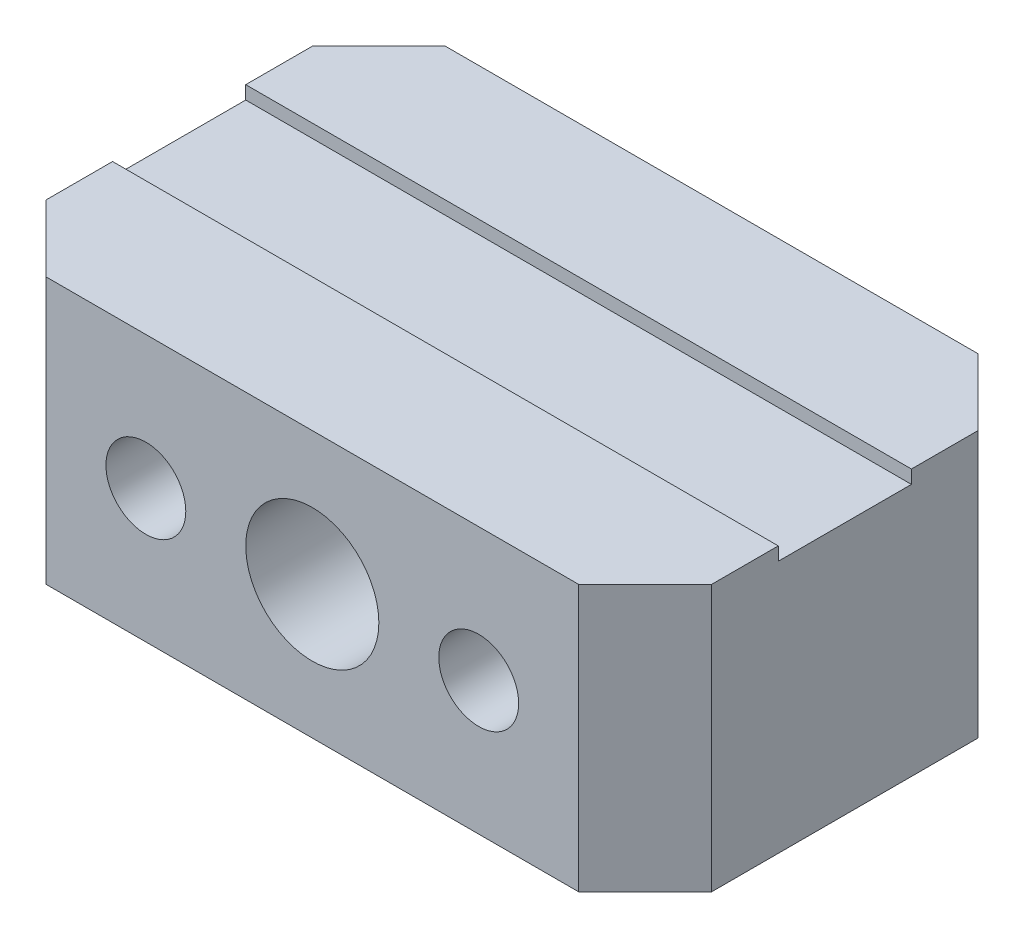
from build123d import *

# Parameters (mm, degrees)
SKETCH_1_W          = 100
SKETCH_1_H          = 40
EXTRUDE_1_DEPTH     = 60
SKETCH_2_R          = 10
CUT_EXTRUDE_1_DEPTH = 81.622577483
SKETCH_3_R          = 6
CUT_EXTRUDE_2_DEPTH = 81.622577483
SKETCH_4_W          = 100
SKETCH_4_H          = 20
CUT_EXTRUDE_3_DEPTH = 2
CHAMFER_1_SIZE      = 10


with BuildPart() as part:
    # Sketch 1 → Extrude 1 (new body)
    with BuildSketch(Plane.XY):
        Rectangle(SKETCH_1_W, SKETCH_1_H)
    extrude(amount=EXTRUDE_1_DEPTH)

    # Sketch 2 → Cut-Extrude 1 (cut, through all)
    with BuildSketch(Plane.XY.offset(60)):
        Circle(SKETCH_2_R)
    extrude(amount=-CUT_EXTRUDE_1_DEPTH, mode=Mode.SUBTRACT)

    # Sketch 3 → Cut-Extrude 2 (cut, through all)
    with BuildSketch(Plane.XY.offset(60)):
        with Locations((-25, 0)):
            Circle(SKETCH_3_R)
        with Locations((25, 0)):
            Circle(SKETCH_3_R)
    extrude(amount=-CUT_EXTRUDE_2_DEPTH, mode=Mode.SUBTRACT)

    # Sketch 4 → Cut-Extrude 3 (cut)
    with BuildSketch(Plane(origin=(0, 20, 0), x_dir=(1, 0, 0), z_dir=(0, 1, 0))):
        with Locations((0, -30)):
            Rectangle(SKETCH_4_W, SKETCH_4_H)
    extrude(amount=-CUT_EXTRUDE_3_DEPTH, mode=Mode.SUBTRACT)

    # Chamfer 1
    chamfer_1_edges = [part.edges().sort_by_distance(p)[0] for p in [
        (50, 0, 60),
        (-50, 0, 60),
        (50, 0, 0),
        (-50, 0, 0),
    ]]
    chamfer(chamfer_1_edges, length=CHAMFER_1_SIZE)


solid = part.part
